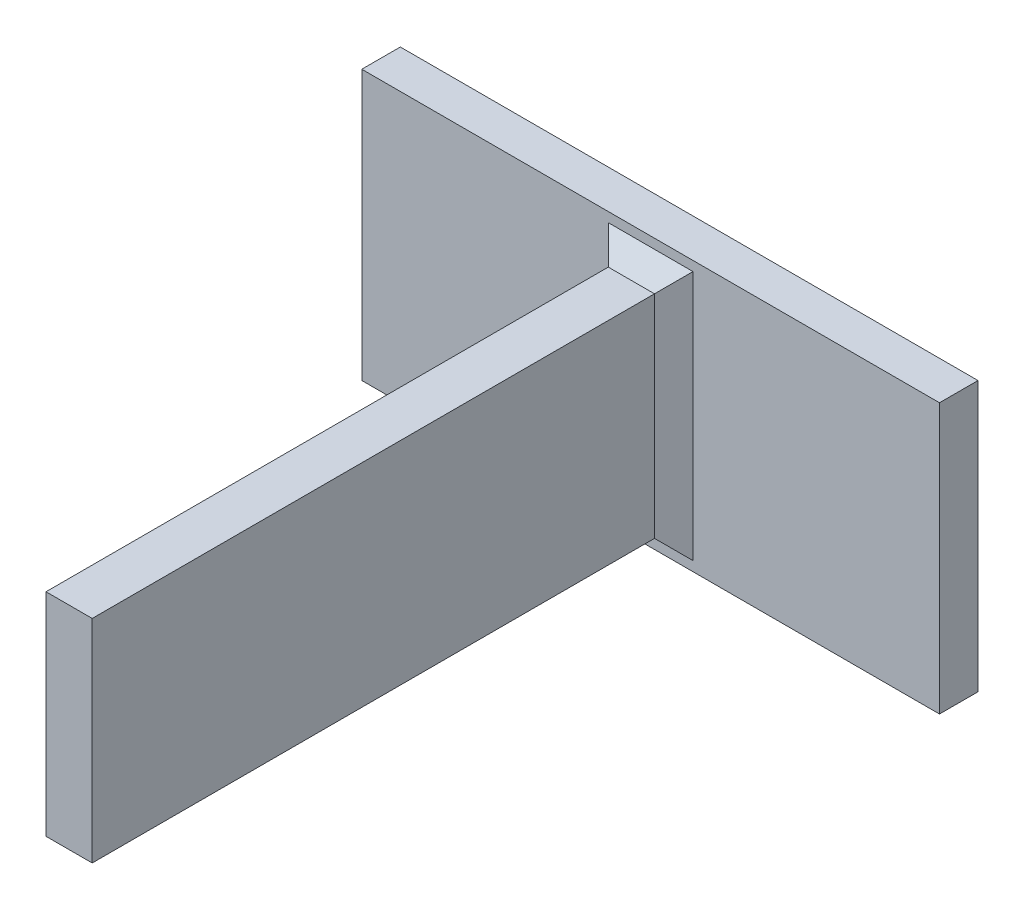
ISO-10303-21;
HEADER;
FILE_DESCRIPTION(('STEP AP214'),'2;1');
FILE_NAME('part.step','',(''),(''),'','','');
FILE_SCHEMA(('AUTOMOTIVE_DESIGN { 1 0 10303 214 1 1 1 1 }'));
ENDSEC;
DATA;
#1=APPLICATION_CONTEXT('core data for automotive mechanical design processes');
#2=APPLICATION_PROTOCOL_DEFINITION('international standard','automotive_design',2000,#1);
#3=PRODUCT_CONTEXT('',#1,'mechanical');
#4=PRODUCT('Part','Part','',(#3));
#5=PRODUCT_RELATED_PRODUCT_CATEGORY('part','',(#4));
#6=PRODUCT_DEFINITION_FORMATION('','',#4);
#7=PRODUCT_DEFINITION_CONTEXT('part definition',#1,'design');
#8=PRODUCT_DEFINITION('design','',#6,#7);
#9=PRODUCT_DEFINITION_SHAPE('','',#8);
#10=(LENGTH_UNIT() NAMED_UNIT(*) SI_UNIT(.MILLI.,.METRE.));
#11=(NAMED_UNIT(*) PLANE_ANGLE_UNIT() SI_UNIT($,.RADIAN.));
#12=(NAMED_UNIT(*) SI_UNIT($,.STERADIAN.) SOLID_ANGLE_UNIT());
#13=UNCERTAINTY_MEASURE_WITH_UNIT(LENGTH_MEASURE(1.E-05),#10,'distance_accuracy_value','');
#14=(GEOMETRIC_REPRESENTATION_CONTEXT(3) GLOBAL_UNCERTAINTY_ASSIGNED_CONTEXT((#13)) GLOBAL_UNIT_ASSIGNED_CONTEXT((#10,
#11,#12)) REPRESENTATION_CONTEXT('',''));
#15=CARTESIAN_POINT('',(0.,0.,0.));
#16=DIRECTION('',(0.,0.,1.));
#17=DIRECTION('',(1.,0.,0.));
#18=AXIS2_PLACEMENT_3D('',#15,#16,#17);
#19=CARTESIAN_POINT('',(6.,-27.5,161.));
#20=DIRECTION('',(-1.,0.,0.));
#21=DIRECTION('',(0.,0.,1.));
#22=AXIS2_PLACEMENT_3D('',#19,#20,#21);
#23=PLANE('',#22);
#24=DIRECTION('',(0.,0.,-1.));
#25=VECTOR('',#24,1.);
#26=CARTESIAN_POINT('',(6.,27.5,161.));
#27=LINE('',#26,#25);
#28=CARTESIAN_POINT('',(6.,27.5,15.));
#29=VERTEX_POINT('',#28);
#30=CARTESIAN_POINT('',(6.,27.5,11.));
#31=VERTEX_POINT('',#30);
#32=EDGE_CURVE('E117',#29,#31,#27,.T.);
#33=ORIENTED_EDGE('',*,*,#32,.T.);
#34=DIRECTION('',(0.,1.,0.));
#35=VECTOR('',#34,1.);
#36=CARTESIAN_POINT('',(6.,0.,11.));
#37=LINE('',#36,#35);
#38=CARTESIAN_POINT('',(6.,-27.5,11.));
#39=VERTEX_POINT('',#38);
#40=EDGE_CURVE('E105',#39,#31,#37,.T.);
#41=ORIENTED_EDGE('',*,*,#40,.F.);
#42=DIRECTION('',(0.,0.,-1.));
#43=VECTOR('',#42,1.);
#44=CARTESIAN_POINT('',(6.,-27.5,161.));
#45=LINE('',#44,#43);
#46=CARTESIAN_POINT('',(6.,-27.5,15.));
#47=VERTEX_POINT('',#46);
#48=EDGE_CURVE('E132',#47,#39,#45,.T.);
#49=ORIENTED_EDGE('',*,*,#48,.F.);
#50=DIRECTION('',(0.,1.,0.));
#51=VECTOR('',#50,1.);
#52=CARTESIAN_POINT('',(6.,-27.5,15.));
#53=LINE('',#52,#51);
#54=EDGE_CURVE('E62',#47,#29,#53,.T.);
#55=ORIENTED_EDGE('',*,*,#54,.T.);
#56=EDGE_LOOP('',(#33,#41,#49,#55));
#57=FACE_BOUND('',#56,.T.);
#58=ADVANCED_FACE('F53',(#57),#23,.T.);
#59=CARTESIAN_POINT('',(-6.,-27.5,161.));
#60=DIRECTION('',(0.,1.,0.));
#61=DIRECTION('',(0.,0.,1.));
#62=AXIS2_PLACEMENT_3D('',#59,#60,#61);
#63=PLANE('',#62);
#64=ORIENTED_EDGE('',*,*,#48,.T.);
#65=DIRECTION('',(1.,0.,0.));
#66=VECTOR('',#65,1.);
#67=CARTESIAN_POINT('',(0.,-27.5,11.));
#68=LINE('',#67,#66);
#69=CARTESIAN_POINT('',(-6.,-27.5,11.));
#70=VERTEX_POINT('',#69);
#71=EDGE_CURVE('E108',#70,#39,#68,.T.);
#72=ORIENTED_EDGE('',*,*,#71,.F.);
#73=DIRECTION('',(0.,0.,-1.));
#74=VECTOR('',#73,1.);
#75=CARTESIAN_POINT('',(-6.,-27.5,161.));
#76=LINE('',#75,#74);
#77=CARTESIAN_POINT('',(-6.,-27.5,15.));
#78=VERTEX_POINT('',#77);
#79=EDGE_CURVE('E127',#78,#70,#76,.T.);
#80=ORIENTED_EDGE('',*,*,#79,.F.);
#81=DIRECTION('',(1.,0.,0.));
#82=VECTOR('',#81,1.);
#83=CARTESIAN_POINT('',(-6.,-27.5,15.));
#84=LINE('',#83,#82);
#85=EDGE_CURVE('E146',#78,#47,#84,.T.);
#86=ORIENTED_EDGE('',*,*,#85,.T.);
#87=EDGE_LOOP('',(#64,#72,#80,#86));
#88=FACE_BOUND('',#87,.T.);
#89=ADVANCED_FACE('F173',(#88),#63,.T.);
#90=CARTESIAN_POINT('',(-6.,27.5,161.));
#91=DIRECTION('',(0.,-1.,0.));
#92=DIRECTION('',(0.,0.,-1.));
#93=AXIS2_PLACEMENT_3D('',#90,#91,#92);
#94=PLANE('',#93);
#95=DIRECTION('',(0.,0.,-1.));
#96=VECTOR('',#95,1.);
#97=CARTESIAN_POINT('',(-6.,27.5,161.));
#98=LINE('',#97,#96);
#99=CARTESIAN_POINT('',(-6.,27.5,15.));
#100=VERTEX_POINT('',#99);
#101=CARTESIAN_POINT('',(-6.,27.5,11.));
#102=VERTEX_POINT('',#101);
#103=EDGE_CURVE('E77',#100,#102,#98,.T.);
#104=ORIENTED_EDGE('',*,*,#103,.T.);
#105=DIRECTION('',(-1.,0.,0.));
#106=VECTOR('',#105,1.);
#107=CARTESIAN_POINT('',(0.,27.5,11.));
#108=LINE('',#107,#106);
#109=EDGE_CURVE('E70',#31,#102,#108,.T.);
#110=ORIENTED_EDGE('',*,*,#109,.F.);
#111=ORIENTED_EDGE('',*,*,#32,.F.);
#112=DIRECTION('',(-1.,0.,0.));
#113=VECTOR('',#112,1.);
#114=CARTESIAN_POINT('',(-6.,27.5,15.));
#115=LINE('',#114,#113);
#116=EDGE_CURVE('E12',#29,#100,#115,.T.);
#117=ORIENTED_EDGE('',*,*,#116,.T.);
#118=EDGE_LOOP('',(#104,#110,#111,#117));
#119=FACE_BOUND('',#118,.T.);
#120=ADVANCED_FACE('F116',(#119),#94,.T.);
#121=CARTESIAN_POINT('',(-6.,-27.5,161.));
#122=DIRECTION('',(1.,0.,0.));
#123=DIRECTION('',(0.,0.,-1.));
#124=AXIS2_PLACEMENT_3D('',#121,#122,#123);
#125=PLANE('',#124);
#126=ORIENTED_EDGE('',*,*,#79,.T.);
#127=DIRECTION('',(0.,-1.,0.));
#128=VECTOR('',#127,1.);
#129=CARTESIAN_POINT('',(-6.,0.,11.));
#130=LINE('',#129,#128);
#131=EDGE_CURVE('E119',#102,#70,#130,.T.);
#132=ORIENTED_EDGE('',*,*,#131,.F.);
#133=ORIENTED_EDGE('',*,*,#103,.F.);
#134=DIRECTION('',(0.,-1.,0.));
#135=VECTOR('',#134,1.);
#136=CARTESIAN_POINT('',(-6.,-27.5,15.));
#137=LINE('',#136,#135);
#138=EDGE_CURVE('E144',#100,#78,#137,.T.);
#139=ORIENTED_EDGE('',*,*,#138,.T.);
#140=EDGE_LOOP('',(#126,#132,#133,#139));
#141=FACE_BOUND('',#140,.T.);
#142=ADVANCED_FACE('F171',(#141),#125,.T.);
#143=CARTESIAN_POINT('',(11.,0.,10.));
#144=DIRECTION('',(-0.707106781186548,0.,-0.707106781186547));
#145=DIRECTION('',(0.,-1.,0.));
#146=AXIS2_PLACEMENT_3D('',#143,#144,#145);
#147=PLANE('',#146);
#148=DIRECTION('',(0.577350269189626,0.577350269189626,-0.577350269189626));
#149=VECTOR('',#148,1.);
#150=CARTESIAN_POINT('',(7.33333333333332,28.8333333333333,13.6666666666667));
#151=LINE('',#150,#149);
#152=CARTESIAN_POINT('',(11.,32.5,10.));
#153=VERTEX_POINT('',#152);
#154=EDGE_CURVE('E150',#29,#153,#151,.T.);
#155=ORIENTED_EDGE('',*,*,#154,.F.);
#156=ORIENTED_EDGE('',*,*,#54,.F.);
#157=DIRECTION('',(0.577350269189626,-0.577350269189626,-0.577350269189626));
#158=VECTOR('',#157,1.);
#159=CARTESIAN_POINT('',(0.166666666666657,-21.6666666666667,20.8333333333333));
#160=LINE('',#159,#158);
#161=CARTESIAN_POINT('',(11.,-32.5,10.));
#162=VERTEX_POINT('',#161);
#163=EDGE_CURVE('E57',#162,#47,#160,.F.);
#164=ORIENTED_EDGE('',*,*,#163,.F.);
#165=DIRECTION('',(0.,-1.,0.));
#166=VECTOR('',#165,1.);
#167=CARTESIAN_POINT('',(11.,0.,10.));
#168=LINE('',#167,#166);
#169=EDGE_CURVE('E138',#153,#162,#168,.T.);
#170=ORIENTED_EDGE('',*,*,#169,.F.);
#171=EDGE_LOOP('',(#155,#156,#164,#170));
#172=FACE_BOUND('',#171,.T.);
#173=ADVANCED_FACE('F55',(#172),#147,.F.);
#174=CARTESIAN_POINT('',(0.,-32.5,10.));
#175=DIRECTION('',(0.,0.707106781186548,-0.707106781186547));
#176=DIRECTION('',(-1.,0.,0.));
#177=AXIS2_PLACEMENT_3D('',#174,#175,#176);
#178=PLANE('',#177);
#179=ORIENTED_EDGE('',*,*,#163,.T.);
#180=ORIENTED_EDGE('',*,*,#85,.F.);
#181=DIRECTION('',(-0.577350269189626,-0.577350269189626,-0.577350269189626));
#182=VECTOR('',#181,1.);
#183=CARTESIAN_POINT('',(-7.33333333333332,-28.8333333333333,13.6666666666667));
#184=LINE('',#183,#182);
#185=CARTESIAN_POINT('',(-11.,-32.5,10.));
#186=VERTEX_POINT('',#185);
#187=EDGE_CURVE('E125',#186,#78,#184,.F.);
#188=ORIENTED_EDGE('',*,*,#187,.F.);
#189=DIRECTION('',(-1.,0.,0.));
#190=VECTOR('',#189,1.);
#191=CARTESIAN_POINT('',(0.,-32.5,10.));
#192=LINE('',#191,#190);
#193=EDGE_CURVE('E140',#162,#186,#192,.T.);
#194=ORIENTED_EDGE('',*,*,#193,.F.);
#195=EDGE_LOOP('',(#179,#180,#188,#194));
#196=FACE_BOUND('',#195,.T.);
#197=ADVANCED_FACE('F160',(#196),#178,.F.);
#198=CARTESIAN_POINT('',(0.,32.5,10.));
#199=DIRECTION('',(0.,-0.707106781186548,-0.707106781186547));
#200=DIRECTION('',(1.,0.,0.));
#201=AXIS2_PLACEMENT_3D('',#198,#199,#200);
#202=PLANE('',#201);
#203=ORIENTED_EDGE('',*,*,#154,.T.);
#204=DIRECTION('',(1.,0.,0.));
#205=VECTOR('',#204,1.);
#206=CARTESIAN_POINT('',(0.,32.5,10.));
#207=LINE('',#206,#205);
#208=CARTESIAN_POINT('',(-11.,32.5,10.));
#209=VERTEX_POINT('',#208);
#210=EDGE_CURVE('E136',#209,#153,#207,.T.);
#211=ORIENTED_EDGE('',*,*,#210,.F.);
#212=DIRECTION('',(0.577350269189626,-0.577350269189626,0.577350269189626));
#213=VECTOR('',#212,1.);
#214=CARTESIAN_POINT('',(-7.33333333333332,28.8333333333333,13.6666666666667));
#215=LINE('',#214,#213);
#216=EDGE_CURVE('E122',#100,#209,#215,.F.);
#217=ORIENTED_EDGE('',*,*,#216,.F.);
#218=ORIENTED_EDGE('',*,*,#116,.F.);
#219=EDGE_LOOP('',(#203,#211,#217,#218));
#220=FACE_BOUND('',#219,.T.);
#221=ADVANCED_FACE('F165',(#220),#202,.F.);
#222=CARTESIAN_POINT('',(-11.,0.,10.));
#223=DIRECTION('',(0.707106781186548,0.,-0.707106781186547));
#224=DIRECTION('',(0.,1.,0.));
#225=AXIS2_PLACEMENT_3D('',#222,#223,#224);
#226=PLANE('',#225);
#227=ORIENTED_EDGE('',*,*,#187,.T.);
#228=ORIENTED_EDGE('',*,*,#138,.F.);
#229=ORIENTED_EDGE('',*,*,#216,.T.);
#230=DIRECTION('',(0.,1.,0.));
#231=VECTOR('',#230,1.);
#232=CARTESIAN_POINT('',(-11.,0.,10.));
#233=LINE('',#232,#231);
#234=EDGE_CURVE('E142',#186,#209,#233,.T.);
#235=ORIENTED_EDGE('',*,*,#234,.F.);
#236=EDGE_LOOP('',(#227,#228,#229,#235));
#237=FACE_BOUND('',#236,.T.);
#238=ADVANCED_FACE('F168',(#237),#226,.F.);
#239=CARTESIAN_POINT('',(0.,0.,10.));
#240=DIRECTION('',(0.,0.,1.));
#241=DIRECTION('',(1.,0.,0.));
#242=AXIS2_PLACEMENT_3D('',#239,#240,#241);
#243=PLANE('',#242);
#244=ORIENTED_EDGE('',*,*,#193,.T.);
#245=ORIENTED_EDGE('',*,*,#234,.T.);
#246=ORIENTED_EDGE('',*,*,#210,.T.);
#247=ORIENTED_EDGE('',*,*,#169,.T.);
#248=EDGE_LOOP('',(#244,#245,#246,#247));
#249=FACE_BOUND('',#248,.T.);
#250=ADVANCED_FACE('F186',(#249),#243,.F.);
#251=CARTESIAN_POINT('',(0.,0.,11.));
#252=DIRECTION('',(0.,0.,-1.));
#253=DIRECTION('',(-1.,0.,0.));
#254=AXIS2_PLACEMENT_3D('',#251,#252,#253);
#255=PLANE('',#254);
#256=ORIENTED_EDGE('',*,*,#40,.T.);
#257=ORIENTED_EDGE('',*,*,#109,.T.);
#258=ORIENTED_EDGE('',*,*,#131,.T.);
#259=ORIENTED_EDGE('',*,*,#71,.T.);
#260=EDGE_LOOP('',(#256,#257,#258,#259));
#261=FACE_BOUND('',#260,.T.);
#262=ADVANCED_FACE('F106',(#261),#255,.F.);
#263=CLOSED_SHELL('',(#58,#89,#120,#142,#173,#197,#221,#238,#250,#262));
#264=MANIFOLD_SOLID_BREP('B2',#263);
#265=CARTESIAN_POINT('',(6.,-27.5,161.));
#266=DIRECTION('',(-1.,0.,0.));
#267=DIRECTION('',(0.,0.,1.));
#268=AXIS2_PLACEMENT_3D('',#265,#266,#267);
#269=PLANE('',#268);
#270=DIRECTION('',(0.,1.,0.));
#271=VECTOR('',#270,1.);
#272=CARTESIAN_POINT('',(6.,-27.5,11.));
#273=LINE('',#272,#271);
#274=CARTESIAN_POINT('',(6.,-27.5,11.));
#275=VERTEX_POINT('',#274);
#276=CARTESIAN_POINT('',(6.,27.5,11.));
#277=VERTEX_POINT('',#276);
#278=EDGE_CURVE('E350',#275,#277,#273,.T.);
#279=ORIENTED_EDGE('',*,*,#278,.T.);
#280=DIRECTION('',(0.,0.,-1.));
#281=VECTOR('',#280,1.);
#282=CARTESIAN_POINT('',(6.,27.5,161.));
#283=LINE('',#282,#281);
#284=CARTESIAN_POINT('',(6.,27.5,161.));
#285=VERTEX_POINT('',#284);
#286=EDGE_CURVE('E51',#285,#277,#283,.T.);
#287=ORIENTED_EDGE('',*,*,#286,.F.);
#288=DIRECTION('',(0.,1.,0.));
#289=VECTOR('',#288,1.);
#290=CARTESIAN_POINT('',(6.,-27.5,161.));
#291=LINE('',#290,#289);
#292=CARTESIAN_POINT('',(6.,-27.5,161.));
#293=VERTEX_POINT('',#292);
#294=EDGE_CURVE('E339',#293,#285,#291,.T.);
#295=ORIENTED_EDGE('',*,*,#294,.F.);
#296=DIRECTION('',(0.,0.,-1.));
#297=VECTOR('',#296,1.);
#298=CARTESIAN_POINT('',(6.,-27.5,161.));
#299=LINE('',#298,#297);
#300=EDGE_CURVE('E347',#293,#275,#299,.T.);
#301=ORIENTED_EDGE('',*,*,#300,.T.);
#302=EDGE_LOOP('',(#279,#287,#295,#301));
#303=FACE_BOUND('',#302,.T.);
#304=ADVANCED_FACE('F288',(#303),#269,.F.);
#305=CARTESIAN_POINT('',(-6.,27.5,161.));
#306=DIRECTION('',(0.,-1.,0.));
#307=DIRECTION('',(0.,0.,-1.));
#308=AXIS2_PLACEMENT_3D('',#305,#306,#307);
#309=PLANE('',#308);
#310=DIRECTION('',(-1.,0.,0.));
#311=VECTOR('',#310,1.);
#312=CARTESIAN_POINT('',(-6.,27.5,11.));
#313=LINE('',#312,#311);
#314=CARTESIAN_POINT('',(-6.,27.5,11.));
#315=VERTEX_POINT('',#314);
#316=EDGE_CURVE('E343',#277,#315,#313,.T.);
#317=ORIENTED_EDGE('',*,*,#316,.T.);
#318=DIRECTION('',(0.,0.,-1.));
#319=VECTOR('',#318,1.);
#320=CARTESIAN_POINT('',(-6.,27.5,161.));
#321=LINE('',#320,#319);
#322=CARTESIAN_POINT('',(-6.,27.5,161.));
#323=VERTEX_POINT('',#322);
#324=EDGE_CURVE('E296',#323,#315,#321,.T.);
#325=ORIENTED_EDGE('',*,*,#324,.F.);
#326=DIRECTION('',(-1.,0.,0.));
#327=VECTOR('',#326,1.);
#328=CARTESIAN_POINT('',(-6.,27.5,161.));
#329=LINE('',#328,#327);
#330=EDGE_CURVE('E334',#285,#323,#329,.T.);
#331=ORIENTED_EDGE('',*,*,#330,.F.);
#332=ORIENTED_EDGE('',*,*,#286,.T.);
#333=EDGE_LOOP('',(#317,#325,#331,#332));
#334=FACE_BOUND('',#333,.T.);
#335=ADVANCED_FACE('F342',(#334),#309,.F.);
#336=CARTESIAN_POINT('',(-6.,-27.5,161.));
#337=DIRECTION('',(1.,0.,0.));
#338=DIRECTION('',(0.,0.,-1.));
#339=AXIS2_PLACEMENT_3D('',#336,#337,#338);
#340=PLANE('',#339);
#341=DIRECTION('',(0.,-1.,0.));
#342=VECTOR('',#341,1.);
#343=CARTESIAN_POINT('',(-6.,-27.5,11.));
#344=LINE('',#343,#342);
#345=CARTESIAN_POINT('',(-6.,-27.5,11.));
#346=VERTEX_POINT('',#345);
#347=EDGE_CURVE('E321',#315,#346,#344,.T.);
#348=ORIENTED_EDGE('',*,*,#347,.T.);
#349=DIRECTION('',(0.,0.,-1.));
#350=VECTOR('',#349,1.);
#351=CARTESIAN_POINT('',(-6.,-27.5,161.));
#352=LINE('',#351,#350);
#353=CARTESIAN_POINT('',(-6.,-27.5,161.));
#354=VERTEX_POINT('',#353);
#355=EDGE_CURVE('E344',#354,#346,#352,.T.);
#356=ORIENTED_EDGE('',*,*,#355,.F.);
#357=DIRECTION('',(0.,-1.,0.));
#358=VECTOR('',#357,1.);
#359=CARTESIAN_POINT('',(-6.,-27.5,161.));
#360=LINE('',#359,#358);
#361=EDGE_CURVE('E337',#323,#354,#360,.T.);
#362=ORIENTED_EDGE('',*,*,#361,.F.);
#363=ORIENTED_EDGE('',*,*,#324,.T.);
#364=EDGE_LOOP('',(#348,#356,#362,#363));
#365=FACE_BOUND('',#364,.T.);
#366=ADVANCED_FACE('F345',(#365),#340,.F.);
#367=CARTESIAN_POINT('',(-6.,-27.5,161.));
#368=DIRECTION('',(0.,1.,0.));
#369=DIRECTION('',(0.,0.,1.));
#370=AXIS2_PLACEMENT_3D('',#367,#368,#369);
#371=PLANE('',#370);
#372=DIRECTION('',(1.,0.,0.));
#373=VECTOR('',#372,1.);
#374=CARTESIAN_POINT('',(-6.,-27.5,11.));
#375=LINE('',#374,#373);
#376=EDGE_CURVE('E327',#346,#275,#375,.T.);
#377=ORIENTED_EDGE('',*,*,#376,.T.);
#378=ORIENTED_EDGE('',*,*,#300,.F.);
#379=DIRECTION('',(1.,0.,0.));
#380=VECTOR('',#379,1.);
#381=CARTESIAN_POINT('',(-6.,-27.5,161.));
#382=LINE('',#381,#380);
#383=EDGE_CURVE('E304',#354,#293,#382,.T.);
#384=ORIENTED_EDGE('',*,*,#383,.F.);
#385=ORIENTED_EDGE('',*,*,#355,.T.);
#386=EDGE_LOOP('',(#377,#378,#384,#385));
#387=FACE_BOUND('',#386,.T.);
#388=ADVANCED_FACE('F357',(#387),#371,.F.);
#389=CARTESIAN_POINT('',(0.,0.,161.));
#390=DIRECTION('',(0.,0.,-1.));
#391=DIRECTION('',(-1.,0.,0.));
#392=AXIS2_PLACEMENT_3D('',#389,#390,#391);
#393=PLANE('',#392);
#394=ORIENTED_EDGE('',*,*,#294,.T.);
#395=ORIENTED_EDGE('',*,*,#330,.T.);
#396=ORIENTED_EDGE('',*,*,#361,.T.);
#397=ORIENTED_EDGE('',*,*,#383,.T.);
#398=EDGE_LOOP('',(#394,#395,#396,#397));
#399=FACE_BOUND('',#398,.T.);
#400=ADVANCED_FACE('F335',(#399),#393,.F.);
#401=CARTESIAN_POINT('',(0.,0.,11.));
#402=DIRECTION('',(0.,0.,-1.));
#403=DIRECTION('',(-1.,0.,0.));
#404=AXIS2_PLACEMENT_3D('',#401,#402,#403);
#405=PLANE('',#404);
#406=ORIENTED_EDGE('',*,*,#278,.F.);
#407=ORIENTED_EDGE('',*,*,#376,.F.);
#408=ORIENTED_EDGE('',*,*,#347,.F.);
#409=ORIENTED_EDGE('',*,*,#316,.F.);
#410=EDGE_LOOP('',(#406,#407,#408,#409));
#411=FACE_BOUND('',#410,.T.);
#412=ADVANCED_FACE('F360',(#411),#405,.T.);
#413=CLOSED_SHELL('',(#304,#335,#366,#388,#400,#412));
#414=MANIFOLD_SOLID_BREP('B6_NOT_SHOWN',#413);
#415=CARTESIAN_POINT('',(75.,35.,10.));
#416=DIRECTION('',(-1.,0.,0.));
#417=DIRECTION('',(0.,-1.,0.));
#418=AXIS2_PLACEMENT_3D('',#415,#416,#417);
#419=PLANE('',#418);
#420=DIRECTION('',(0.,1.,0.));
#421=VECTOR('',#420,1.);
#422=CARTESIAN_POINT('',(75.,35.,0.));
#423=LINE('',#422,#421);
#424=CARTESIAN_POINT('',(75.,-35.,0.));
#425=VERTEX_POINT('',#424);
#426=CARTESIAN_POINT('',(75.,35.,0.));
#427=VERTEX_POINT('',#426);
#428=EDGE_CURVE('E476',#425,#427,#423,.T.);
#429=ORIENTED_EDGE('',*,*,#428,.T.);
#430=DIRECTION('',(0.,0.,-1.));
#431=VECTOR('',#430,1.);
#432=CARTESIAN_POINT('',(75.,35.,10.));
#433=LINE('',#432,#431);
#434=CARTESIAN_POINT('',(75.,35.,10.));
#435=VERTEX_POINT('',#434);
#436=EDGE_CURVE('E286',#435,#427,#433,.T.);
#437=ORIENTED_EDGE('',*,*,#436,.F.);
#438=DIRECTION('',(0.,1.,0.));
#439=VECTOR('',#438,1.);
#440=CARTESIAN_POINT('',(75.,35.,10.));
#441=LINE('',#440,#439);
#442=CARTESIAN_POINT('',(75.,-35.,10.));
#443=VERTEX_POINT('',#442);
#444=EDGE_CURVE('E464',#443,#435,#441,.T.);
#445=ORIENTED_EDGE('',*,*,#444,.F.);
#446=DIRECTION('',(0.,0.,-1.));
#447=VECTOR('',#446,1.);
#448=CARTESIAN_POINT('',(75.,-35.,10.));
#449=LINE('',#448,#447);
#450=EDGE_CURVE('E472',#443,#425,#449,.T.);
#451=ORIENTED_EDGE('',*,*,#450,.T.);
#452=EDGE_LOOP('',(#429,#437,#445,#451));
#453=FACE_BOUND('',#452,.T.);
#454=ADVANCED_FACE('F413',(#453),#419,.F.);
#455=CARTESIAN_POINT('',(-75.,35.,10.));
#456=DIRECTION('',(0.,-1.,0.));
#457=DIRECTION('',(0.,0.,-1.));
#458=AXIS2_PLACEMENT_3D('',#455,#456,#457);
#459=PLANE('',#458);
#460=DIRECTION('',(-1.,0.,0.));
#461=VECTOR('',#460,1.);
#462=CARTESIAN_POINT('',(-75.,35.,0.));
#463=LINE('',#462,#461);
#464=CARTESIAN_POINT('',(-75.,35.,0.));
#465=VERTEX_POINT('',#464);
#466=EDGE_CURVE('E468',#427,#465,#463,.T.);
#467=ORIENTED_EDGE('',*,*,#466,.T.);
#468=DIRECTION('',(0.,0.,-1.));
#469=VECTOR('',#468,1.);
#470=CARTESIAN_POINT('',(-75.,35.,10.));
#471=LINE('',#470,#469);
#472=CARTESIAN_POINT('',(-75.,35.,10.));
#473=VERTEX_POINT('',#472);
#474=EDGE_CURVE('E421',#473,#465,#471,.T.);
#475=ORIENTED_EDGE('',*,*,#474,.F.);
#476=DIRECTION('',(-1.,0.,0.));
#477=VECTOR('',#476,1.);
#478=CARTESIAN_POINT('',(-75.,35.,10.));
#479=LINE('',#478,#477);
#480=EDGE_CURVE('E459',#435,#473,#479,.T.);
#481=ORIENTED_EDGE('',*,*,#480,.F.);
#482=ORIENTED_EDGE('',*,*,#436,.T.);
#483=EDGE_LOOP('',(#467,#475,#481,#482));
#484=FACE_BOUND('',#483,.T.);
#485=ADVANCED_FACE('F467',(#484),#459,.F.);
#486=CARTESIAN_POINT('',(-75.,35.,10.));
#487=DIRECTION('',(1.,0.,0.));
#488=DIRECTION('',(0.,1.,0.));
#489=AXIS2_PLACEMENT_3D('',#486,#487,#488);
#490=PLANE('',#489);
#491=DIRECTION('',(0.,-1.,0.));
#492=VECTOR('',#491,1.);
#493=CARTESIAN_POINT('',(-75.,35.,0.));
#494=LINE('',#493,#492);
#495=CARTESIAN_POINT('',(-75.,-35.,0.));
#496=VERTEX_POINT('',#495);
#497=EDGE_CURVE('E446',#465,#496,#494,.T.);
#498=ORIENTED_EDGE('',*,*,#497,.T.);
#499=DIRECTION('',(0.,0.,-1.));
#500=VECTOR('',#499,1.);
#501=CARTESIAN_POINT('',(-75.,-35.,10.));
#502=LINE('',#501,#500);
#503=CARTESIAN_POINT('',(-75.,-35.,10.));
#504=VERTEX_POINT('',#503);
#505=EDGE_CURVE('E469',#504,#496,#502,.T.);
#506=ORIENTED_EDGE('',*,*,#505,.F.);
#507=DIRECTION('',(0.,-1.,0.));
#508=VECTOR('',#507,1.);
#509=CARTESIAN_POINT('',(-75.,35.,10.));
#510=LINE('',#509,#508);
#511=EDGE_CURVE('E462',#473,#504,#510,.T.);
#512=ORIENTED_EDGE('',*,*,#511,.F.);
#513=ORIENTED_EDGE('',*,*,#474,.T.);
#514=EDGE_LOOP('',(#498,#506,#512,#513));
#515=FACE_BOUND('',#514,.T.);
#516=ADVANCED_FACE('F470',(#515),#490,.F.);
#517=CARTESIAN_POINT('',(-75.,-35.,10.));
#518=DIRECTION('',(0.,1.,0.));
#519=DIRECTION('',(0.,0.,1.));
#520=AXIS2_PLACEMENT_3D('',#517,#518,#519);
#521=PLANE('',#520);
#522=DIRECTION('',(1.,0.,0.));
#523=VECTOR('',#522,1.);
#524=CARTESIAN_POINT('',(-75.,-35.,0.));
#525=LINE('',#524,#523);
#526=EDGE_CURVE('E452',#496,#425,#525,.T.);
#527=ORIENTED_EDGE('',*,*,#526,.T.);
#528=ORIENTED_EDGE('',*,*,#450,.F.);
#529=DIRECTION('',(1.,0.,0.));
#530=VECTOR('',#529,1.);
#531=CARTESIAN_POINT('',(-75.,-35.,10.));
#532=LINE('',#531,#530);
#533=EDGE_CURVE('E429',#504,#443,#532,.T.);
#534=ORIENTED_EDGE('',*,*,#533,.F.);
#535=ORIENTED_EDGE('',*,*,#505,.T.);
#536=EDGE_LOOP('',(#527,#528,#534,#535));
#537=FACE_BOUND('',#536,.T.);
#538=ADVANCED_FACE('F483',(#537),#521,.F.);
#539=CARTESIAN_POINT('',(0.,0.,10.));
#540=DIRECTION('',(0.,0.,1.));
#541=DIRECTION('',(1.,0.,0.));
#542=AXIS2_PLACEMENT_3D('',#539,#540,#541);
#543=PLANE('',#542);
#544=ORIENTED_EDGE('',*,*,#444,.T.);
#545=ORIENTED_EDGE('',*,*,#480,.T.);
#546=ORIENTED_EDGE('',*,*,#511,.T.);
#547=ORIENTED_EDGE('',*,*,#533,.T.);
#548=EDGE_LOOP('',(#544,#545,#546,#547));
#549=FACE_BOUND('',#548,.T.);
#550=ADVANCED_FACE('F460',(#549),#543,.T.);
#551=CARTESIAN_POINT('',(0.,0.,0.));
#552=DIRECTION('',(0.,0.,1.));
#553=DIRECTION('',(1.,0.,0.));
#554=AXIS2_PLACEMENT_3D('',#551,#552,#553);
#555=PLANE('',#554);
#556=ORIENTED_EDGE('',*,*,#428,.F.);
#557=ORIENTED_EDGE('',*,*,#526,.F.);
#558=ORIENTED_EDGE('',*,*,#497,.F.);
#559=ORIENTED_EDGE('',*,*,#466,.F.);
#560=EDGE_LOOP('',(#556,#557,#558,#559));
#561=FACE_BOUND('',#560,.T.);
#562=ADVANCED_FACE('F486',(#561),#555,.F.);
#563=CLOSED_SHELL('',(#454,#485,#516,#538,#550,#562));
#564=MANIFOLD_SOLID_BREP('B45',#563);
#565=ADVANCED_BREP_SHAPE_REPRESENTATION('',(#18,#264,#414,#564),#14);
#566=SHAPE_DEFINITION_REPRESENTATION(#9,#565);
ENDSEC;
END-ISO-10303-21;
